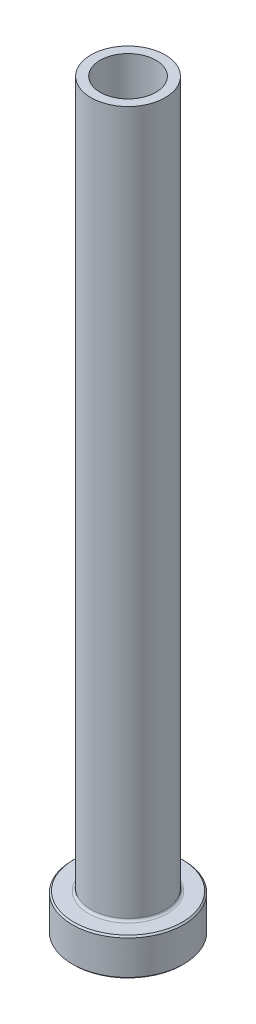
ISO-10303-21;
HEADER;
FILE_DESCRIPTION(('STEP AP214'),'2;1');
FILE_NAME('part.step','',(''),(''),'','','');
FILE_SCHEMA(('AUTOMOTIVE_DESIGN { 1 0 10303 214 1 1 1 1 }'));
ENDSEC;
DATA;
#1=APPLICATION_CONTEXT('core data for automotive mechanical design processes');
#2=APPLICATION_PROTOCOL_DEFINITION('international standard','automotive_design',2000,#1);
#3=PRODUCT_CONTEXT('',#1,'mechanical');
#4=PRODUCT('Part','Part','',(#3));
#5=PRODUCT_RELATED_PRODUCT_CATEGORY('part','',(#4));
#6=PRODUCT_DEFINITION_FORMATION('','',#4);
#7=PRODUCT_DEFINITION_CONTEXT('part definition',#1,'design');
#8=PRODUCT_DEFINITION('design','',#6,#7);
#9=PRODUCT_DEFINITION_SHAPE('','',#8);
#10=(LENGTH_UNIT() NAMED_UNIT(*) SI_UNIT(.MILLI.,.METRE.));
#11=(NAMED_UNIT(*) PLANE_ANGLE_UNIT() SI_UNIT($,.RADIAN.));
#12=(NAMED_UNIT(*) SI_UNIT($,.STERADIAN.) SOLID_ANGLE_UNIT());
#13=UNCERTAINTY_MEASURE_WITH_UNIT(LENGTH_MEASURE(1.E-05),#10,'distance_accuracy_value','');
#14=(GEOMETRIC_REPRESENTATION_CONTEXT(3) GLOBAL_UNCERTAINTY_ASSIGNED_CONTEXT((#13)) GLOBAL_UNIT_ASSIGNED_CONTEXT((#10,
#11,#12)) REPRESENTATION_CONTEXT('',''));
#15=CARTESIAN_POINT('',(0.,0.,0.));
#16=DIRECTION('',(0.,0.,1.));
#17=DIRECTION('',(1.,0.,0.));
#18=AXIS2_PLACEMENT_3D('',#15,#16,#17);
#19=CARTESIAN_POINT('',(0.,0.,0.));
#20=DIRECTION('',(0.,-1.,0.));
#21=DIRECTION('',(0.,0.,-1.));
#22=AXIS2_PLACEMENT_3D('',#19,#20,#21);
#23=PLANE('',#22);
#24=CARTESIAN_POINT('',(0.,0.,0.));
#25=DIRECTION('',(0.,-1.,0.));
#26=DIRECTION('',(0.,0.,-1.));
#27=AXIS2_PLACEMENT_3D('',#24,#25,#26);
#28=CIRCLE('',#27,9.271);
#29=CARTESIAN_POINT('',(0.,0.,-9.271));
#30=VERTEX_POINT('',#29);
#31=EDGE_CURVE('E44',#30,#30,#28,.T.);
#32=ORIENTED_EDGE('',*,*,#31,.T.);
#33=EDGE_LOOP('',(#32));
#34=FACE_BOUND('',#33,.T.);
#35=CARTESIAN_POINT('',(0.,0.,0.));
#36=DIRECTION('',(0.,-1.,0.));
#37=DIRECTION('',(0.,0.,-1.));
#38=AXIS2_PLACEMENT_3D('',#35,#36,#37);
#39=CIRCLE('',#38,5.34987500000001);
#40=CARTESIAN_POINT('',(0.,0.,-5.34987500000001));
#41=VERTEX_POINT('',#40);
#42=EDGE_CURVE('E58',#41,#41,#39,.T.);
#43=ORIENTED_EDGE('',*,*,#42,.F.);
#44=EDGE_LOOP('',(#43));
#45=FACE_BOUND('',#44,.T.);
#46=ADVANCED_FACE('F29',(#34,#45),#23,.T.);
#47=CARTESIAN_POINT('',(0.,0.,0.));
#48=DIRECTION('',(0.,-1.,0.));
#49=DIRECTION('',(0.,0.,-1.));
#50=AXIS2_PLACEMENT_3D('',#47,#48,#49);
#51=CYLINDRICAL_SURFACE('',#50,9.525);
#52=CARTESIAN_POINT('',(0.,0.254000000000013,0.));
#53=DIRECTION('',(0.,-1.,0.));
#54=DIRECTION('',(0.,0.,-1.));
#55=AXIS2_PLACEMENT_3D('',#52,#53,#54);
#56=CIRCLE('',#55,9.525);
#57=CARTESIAN_POINT('',(0.,0.254000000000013,-9.525));
#58=VERTEX_POINT('',#57);
#59=EDGE_CURVE('E36',#58,#58,#56,.F.);
#60=ORIENTED_EDGE('',*,*,#59,.T.);
#61=EDGE_LOOP('',(#60));
#62=FACE_BOUND('',#61,.T.);
#63=CARTESIAN_POINT('',(0.,6.09599999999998,0.));
#64=DIRECTION('',(0.,1.,0.));
#65=DIRECTION('',(0.,0.,1.));
#66=AXIS2_PLACEMENT_3D('',#63,#64,#65);
#67=CIRCLE('',#66,9.525);
#68=CARTESIAN_POINT('',(0.,6.09599999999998,9.525));
#69=VERTEX_POINT('',#68);
#70=EDGE_CURVE('E40',#69,#69,#67,.F.);
#71=ORIENTED_EDGE('',*,*,#70,.T.);
#72=EDGE_LOOP('',(#71));
#73=FACE_BOUND('',#72,.T.);
#74=ADVANCED_FACE('F103',(#62,#73),#51,.T.);
#75=CARTESIAN_POINT('',(9.525,6.35,0.));
#76=DIRECTION('',(0.,1.,0.));
#77=DIRECTION('',(0.,0.,1.));
#78=AXIS2_PLACEMENT_3D('',#75,#76,#77);
#79=PLANE('',#78);
#80=CARTESIAN_POINT('',(0.,6.35,0.));
#81=DIRECTION('',(0.,1.,0.));
#82=DIRECTION('',(0.,0.,1.));
#83=AXIS2_PLACEMENT_3D('',#80,#81,#82);
#84=CIRCLE('',#83,9.27099999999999);
#85=CARTESIAN_POINT('',(0.,6.35,9.27099999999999));
#86=VERTEX_POINT('',#85);
#87=EDGE_CURVE('E10',#86,#86,#84,.T.);
#88=ORIENTED_EDGE('',*,*,#87,.T.);
#89=EDGE_LOOP('',(#88));
#90=FACE_BOUND('',#89,.T.);
#91=CARTESIAN_POINT('',(0.,6.35,0.));
#92=DIRECTION('',(0.,-1.,0.));
#93=DIRECTION('',(0.,0.,-1.));
#94=AXIS2_PLACEMENT_3D('',#91,#92,#93);
#95=CIRCLE('',#94,6.740525);
#96=CARTESIAN_POINT('',(0.,6.35,-6.740525));
#97=VERTEX_POINT('',#96);
#98=EDGE_CURVE('E49',#97,#97,#95,.T.);
#99=ORIENTED_EDGE('',*,*,#98,.T.);
#100=EDGE_LOOP('',(#99));
#101=FACE_BOUND('',#100,.T.);
#102=ADVANCED_FACE('F109',(#90,#101),#79,.T.);
#103=CARTESIAN_POINT('',(0.,6.746875,0.));
#104=DIRECTION('',(0.,-1.,0.));
#105=DIRECTION('',(0.,0.,-1.));
#106=AXIS2_PLACEMENT_3D('',#103,#104,#105);
#107=TOROIDAL_SURFACE('',#106,6.740525,0.396875);
#108=CARTESIAN_POINT('',(0.,6.746875,0.));
#109=DIRECTION('',(0.,-1.,0.));
#110=DIRECTION('',(0.,0.,-1.));
#111=AXIS2_PLACEMENT_3D('',#108,#109,#110);
#112=CIRCLE('',#111,6.34365);
#113=CARTESIAN_POINT('',(0.,6.746875,-6.34365));
#114=VERTEX_POINT('',#113);
#115=EDGE_CURVE('E52',#114,#114,#112,.T.);
#116=ORIENTED_EDGE('',*,*,#115,.T.);
#117=EDGE_LOOP('',(#116));
#118=FACE_BOUND('',#117,.T.);
#119=ORIENTED_EDGE('',*,*,#98,.F.);
#120=EDGE_LOOP('',(#119));
#121=FACE_BOUND('',#120,.T.);
#122=ADVANCED_FACE('F139',(#118,#121),#107,.F.);
#123=CARTESIAN_POINT('',(0.,0.,0.));
#124=DIRECTION('',(0.,-1.,0.));
#125=DIRECTION('',(0.,0.,-1.));
#126=AXIS2_PLACEMENT_3D('',#123,#124,#125);
#127=CYLINDRICAL_SURFACE('',#126,6.34365);
#128=CARTESIAN_POINT('',(0.,127.,0.));
#129=DIRECTION('',(0.,-1.,0.));
#130=DIRECTION('',(0.,0.,-1.));
#131=AXIS2_PLACEMENT_3D('',#128,#129,#130);
#132=CIRCLE('',#131,6.34365);
#133=CARTESIAN_POINT('',(0.,127.,-6.34365));
#134=VERTEX_POINT('',#133);
#135=EDGE_CURVE('E55',#134,#134,#132,.T.);
#136=ORIENTED_EDGE('',*,*,#135,.T.);
#137=EDGE_LOOP('',(#136));
#138=FACE_BOUND('',#137,.T.);
#139=ORIENTED_EDGE('',*,*,#115,.F.);
#140=EDGE_LOOP('',(#139));
#141=FACE_BOUND('',#140,.T.);
#142=ADVANCED_FACE('F182',(#138,#141),#127,.T.);
#143=CARTESIAN_POINT('',(6.34365,127.,0.));
#144=DIRECTION('',(0.,1.,0.));
#145=DIRECTION('',(0.,0.,1.));
#146=AXIS2_PLACEMENT_3D('',#143,#144,#145);
#147=PLANE('',#146);
#148=CARTESIAN_POINT('',(0.,127.,0.));
#149=DIRECTION('',(0.,-1.,0.));
#150=DIRECTION('',(0.,0.,-1.));
#151=AXIS2_PLACEMENT_3D('',#148,#149,#150);
#152=CIRCLE('',#151,4.7625);
#153=CARTESIAN_POINT('',(0.,127.,-4.7625));
#154=VERTEX_POINT('',#153);
#155=EDGE_CURVE('E70',#154,#154,#152,.T.);
#156=ORIENTED_EDGE('',*,*,#155,.T.);
#157=EDGE_LOOP('',(#156));
#158=FACE_BOUND('',#157,.T.);
#159=ORIENTED_EDGE('',*,*,#135,.F.);
#160=EDGE_LOOP('',(#159));
#161=FACE_BOUND('',#160,.T.);
#162=ADVANCED_FACE('F74',(#158,#161),#147,.T.);
#163=CARTESIAN_POINT('',(0.,0.,0.));
#164=DIRECTION('',(0.,-1.,0.));
#165=DIRECTION('',(0.,0.,-1.));
#166=AXIS2_PLACEMENT_3D('',#163,#164,#165);
#167=CONICAL_SURFACE('',#166,5.34987500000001,0.785398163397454);
#168=CARTESIAN_POINT('',(0.,0.396875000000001,0.));
#169=DIRECTION('',(0.,-1.,0.));
#170=DIRECTION('',(0.,0.,-1.));
#171=AXIS2_PLACEMENT_3D('',#168,#169,#170);
#172=CIRCLE('',#171,4.953);
#173=CARTESIAN_POINT('',(0.,0.396875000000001,-4.953));
#174=VERTEX_POINT('',#173);
#175=EDGE_CURVE('E61',#174,#174,#172,.T.);
#176=ORIENTED_EDGE('',*,*,#175,.F.);
#177=EDGE_LOOP('',(#176));
#178=FACE_BOUND('',#177,.T.);
#179=ORIENTED_EDGE('',*,*,#42,.T.);
#180=EDGE_LOOP('',(#179));
#181=FACE_BOUND('',#180,.T.);
#182=ADVANCED_FACE('F93',(#178,#181),#167,.F.);
#183=CARTESIAN_POINT('',(0.,0.,0.));
#184=DIRECTION('',(0.,-1.,0.));
#185=DIRECTION('',(0.,0.,-1.));
#186=AXIS2_PLACEMENT_3D('',#183,#184,#185);
#187=CYLINDRICAL_SURFACE('',#186,4.953);
#188=CARTESIAN_POINT('',(0.,52.5145,0.));
#189=DIRECTION('',(0.,-1.,0.));
#190=DIRECTION('',(0.,0.,-1.));
#191=AXIS2_PLACEMENT_3D('',#188,#189,#190);
#192=CIRCLE('',#191,4.953);
#193=CARTESIAN_POINT('',(0.,52.5145,-4.953));
#194=VERTEX_POINT('',#193);
#195=EDGE_CURVE('E64',#194,#194,#192,.T.);
#196=ORIENTED_EDGE('',*,*,#195,.F.);
#197=EDGE_LOOP('',(#196));
#198=FACE_BOUND('',#197,.T.);
#199=ORIENTED_EDGE('',*,*,#175,.T.);
#200=EDGE_LOOP('',(#199));
#201=FACE_BOUND('',#200,.T.);
#202=ADVANCED_FACE('F87',(#198,#201),#187,.F.);
#203=CARTESIAN_POINT('',(0.,52.5145,0.));
#204=DIRECTION('',(0.,-1.,0.));
#205=DIRECTION('',(0.,0.,-1.));
#206=AXIS2_PLACEMENT_3D('',#203,#204,#205);
#207=CONICAL_SURFACE('',#206,4.953,0.0133325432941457);
#208=CARTESIAN_POINT('',(0.,66.802,0.));
#209=DIRECTION('',(0.,-1.,0.));
#210=DIRECTION('',(0.,0.,-1.));
#211=AXIS2_PLACEMENT_3D('',#208,#209,#210);
#212=CIRCLE('',#211,4.7625);
#213=CARTESIAN_POINT('',(0.,66.802,-4.7625));
#214=VERTEX_POINT('',#213);
#215=EDGE_CURVE('E67',#214,#214,#212,.T.);
#216=ORIENTED_EDGE('',*,*,#215,.F.);
#217=EDGE_LOOP('',(#216));
#218=FACE_BOUND('',#217,.T.);
#219=ORIENTED_EDGE('',*,*,#195,.T.);
#220=EDGE_LOOP('',(#219));
#221=FACE_BOUND('',#220,.T.);
#222=ADVANCED_FACE('F81',(#218,#221),#207,.F.);
#223=CARTESIAN_POINT('',(0.,0.,0.));
#224=DIRECTION('',(0.,-1.,0.));
#225=DIRECTION('',(0.,0.,-1.));
#226=AXIS2_PLACEMENT_3D('',#223,#224,#225);
#227=CYLINDRICAL_SURFACE('',#226,4.7625);
#228=ORIENTED_EDGE('',*,*,#155,.F.);
#229=EDGE_LOOP('',(#228));
#230=FACE_BOUND('',#229,.T.);
#231=ORIENTED_EDGE('',*,*,#215,.T.);
#232=EDGE_LOOP('',(#231));
#233=FACE_BOUND('',#232,.T.);
#234=ADVANCED_FACE('F77',(#230,#233),#227,.F.);
#235=CARTESIAN_POINT('',(0.,0.,0.));
#236=DIRECTION('',(0.,1.,0.));
#237=DIRECTION('',(0.,0.,1.));
#238=AXIS2_PLACEMENT_3D('',#235,#236,#237);
#239=CONICAL_SURFACE('',#238,9.271,0.785398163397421);
#240=ORIENTED_EDGE('',*,*,#59,.F.);
#241=EDGE_LOOP('',(#240));
#242=FACE_BOUND('',#241,.T.);
#243=ORIENTED_EDGE('',*,*,#31,.F.);
#244=EDGE_LOOP('',(#243));
#245=FACE_BOUND('',#244,.T.);
#246=ADVANCED_FACE('F80',(#242,#245),#239,.T.);
#247=CARTESIAN_POINT('',(0.,6.09599999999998,0.));
#248=DIRECTION('',(0.,-1.,0.));
#249=DIRECTION('',(0.,0.,-1.));
#250=AXIS2_PLACEMENT_3D('',#247,#248,#249);
#251=CONICAL_SURFACE('',#250,9.525,0.785398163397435);
#252=ORIENTED_EDGE('',*,*,#87,.F.);
#253=EDGE_LOOP('',(#252));
#254=FACE_BOUND('',#253,.T.);
#255=ORIENTED_EDGE('',*,*,#70,.F.);
#256=EDGE_LOOP('',(#255));
#257=FACE_BOUND('',#256,.T.);
#258=ADVANCED_FACE('F31',(#254,#257),#251,.T.);
#259=CLOSED_SHELL('',(#46,#74,#102,#122,#142,#162,#182,#202,#222,#234,#246,#258));
#260=MANIFOLD_SOLID_BREP('B2',#259);
#261=ADVANCED_BREP_SHAPE_REPRESENTATION('',(#18,#260),#14);
#262=SHAPE_DEFINITION_REPRESENTATION(#9,#261);
ENDSEC;
END-ISO-10303-21;
